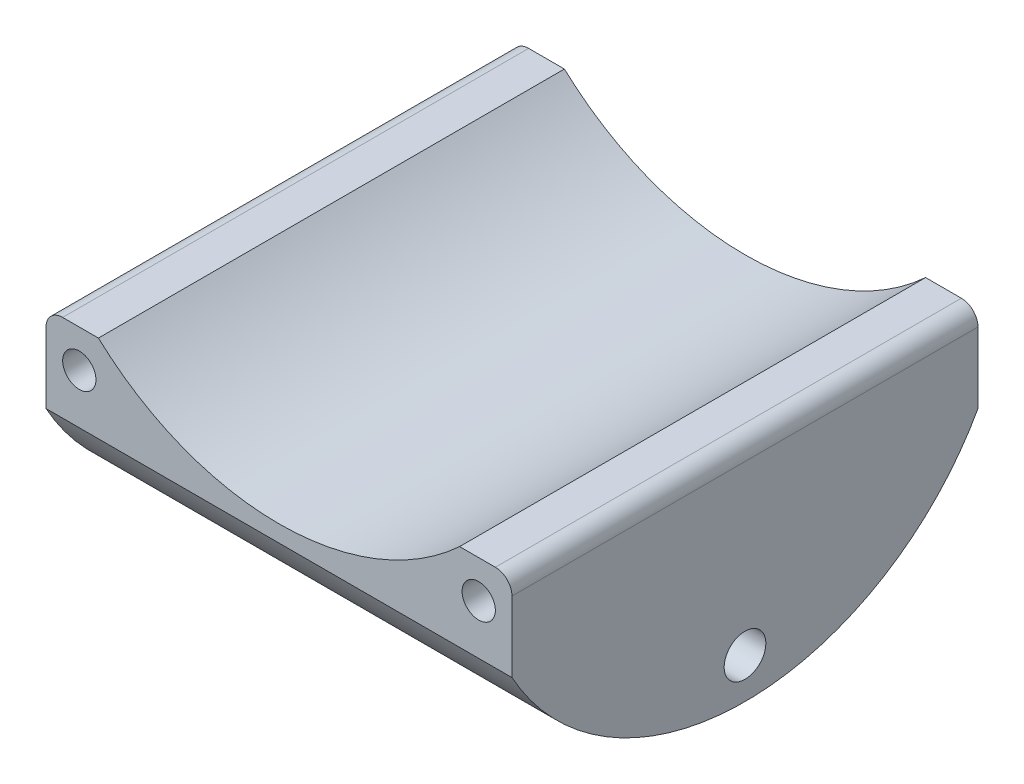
ISO-10303-21;
HEADER;
FILE_DESCRIPTION(('STEP AP214'),'2;1');
FILE_NAME('part.step','',(''),(''),'','','');
FILE_SCHEMA(('AUTOMOTIVE_DESIGN { 1 0 10303 214 1 1 1 1 }'));
ENDSEC;
DATA;
#1=APPLICATION_CONTEXT('core data for automotive mechanical design processes');
#2=APPLICATION_PROTOCOL_DEFINITION('international standard','automotive_design',2000,#1);
#3=PRODUCT_CONTEXT('',#1,'mechanical');
#4=PRODUCT('Part','Part','',(#3));
#5=PRODUCT_RELATED_PRODUCT_CATEGORY('part','',(#4));
#6=PRODUCT_DEFINITION_FORMATION('','',#4);
#7=PRODUCT_DEFINITION_CONTEXT('part definition',#1,'design');
#8=PRODUCT_DEFINITION('design','',#6,#7);
#9=PRODUCT_DEFINITION_SHAPE('','',#8);
#10=(LENGTH_UNIT() NAMED_UNIT(*) SI_UNIT(.MILLI.,.METRE.));
#11=(NAMED_UNIT(*) PLANE_ANGLE_UNIT() SI_UNIT($,.RADIAN.));
#12=(NAMED_UNIT(*) SI_UNIT($,.STERADIAN.) SOLID_ANGLE_UNIT());
#13=UNCERTAINTY_MEASURE_WITH_UNIT(LENGTH_MEASURE(1.E-05),#10,'distance_accuracy_value','');
#14=(GEOMETRIC_REPRESENTATION_CONTEXT(3) GLOBAL_UNCERTAINTY_ASSIGNED_CONTEXT((#13)) GLOBAL_UNIT_ASSIGNED_CONTEXT((#10,
#11,#12)) REPRESENTATION_CONTEXT('',''));
#15=CARTESIAN_POINT('',(0.,0.,0.));
#16=DIRECTION('',(0.,0.,1.));
#17=DIRECTION('',(1.,0.,0.));
#18=AXIS2_PLACEMENT_3D('',#15,#16,#17);
#19=CARTESIAN_POINT('',(-44.45,7.9502,0.));
#20=DIRECTION('',(1.,0.,0.));
#21=DIRECTION('',(0.,0.,-1.));
#22=AXIS2_PLACEMENT_3D('',#19,#20,#21);
#23=PLANE('',#22);
#24=DIRECTION('',(0.,-1.,0.));
#25=VECTOR('',#24,1.);
#26=CARTESIAN_POINT('',(-44.45,0.,44.45));
#27=LINE('',#26,#25);
#28=CARTESIAN_POINT('',(-44.45,-3.175,44.45));
#29=VERTEX_POINT('',#28);
#30=CARTESIAN_POINT('',(-44.45,-16.6432442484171,44.45));
#31=VERTEX_POINT('',#30);
#32=EDGE_CURVE('E161',#29,#31,#27,.T.);
#33=ORIENTED_EDGE('',*,*,#32,.F.);
#34=DIRECTION('',(0.,0.,-1.));
#35=VECTOR('',#34,1.);
#36=CARTESIAN_POINT('',(-44.45,-3.175,-44.45));
#37=LINE('',#36,#35);
#38=CARTESIAN_POINT('',(-44.45,-3.175,-44.45));
#39=VERTEX_POINT('',#38);
#40=EDGE_CURVE('E51',#29,#39,#37,.T.);
#41=ORIENTED_EDGE('',*,*,#40,.T.);
#42=DIRECTION('',(0.,-1.,0.));
#43=VECTOR('',#42,1.);
#44=CARTESIAN_POINT('',(-44.45,0.,-44.45));
#45=LINE('',#44,#43);
#46=CARTESIAN_POINT('',(-44.45,-16.6432442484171,-44.45));
#47=VERTEX_POINT('',#46);
#48=EDGE_CURVE('E134',#39,#47,#45,.T.);
#49=ORIENTED_EDGE('',*,*,#48,.T.);
#50=CARTESIAN_POINT('',(-44.45,7.9502,0.));
#51=DIRECTION('',(1.,0.,0.));
#52=DIRECTION('',(0.,0.,-1.));
#53=AXIS2_PLACEMENT_3D('',#50,#51,#52);
#54=CIRCLE('',#53,50.8);
#55=EDGE_CURVE('E170',#31,#47,#54,.T.);
#56=ORIENTED_EDGE('',*,*,#55,.F.);
#57=EDGE_LOOP('',(#33,#41,#49,#56));
#58=FACE_BOUND('',#57,.T.);
#59=CARTESIAN_POINT('',(-44.45,-35.179,0.));
#60=DIRECTION('',(1.,0.,0.));
#61=DIRECTION('',(0.,0.,-1.));
#62=AXIS2_PLACEMENT_3D('',#59,#60,#61);
#63=CIRCLE('',#62,3.9751);
#64=CARTESIAN_POINT('',(-44.45,-35.179,-3.9751));
#65=VERTEX_POINT('',#64);
#66=EDGE_CURVE('E209',#65,#65,#63,.T.);
#67=ORIENTED_EDGE('',*,*,#66,.T.);
#68=EDGE_LOOP('',(#67));
#69=FACE_BOUND('',#68,.T.);
#70=ADVANCED_FACE('F43',(#58,#69),#23,.F.);
#71=CARTESIAN_POINT('',(44.45,0.,-44.45));
#72=DIRECTION('',(0.,0.,-1.));
#73=DIRECTION('',(0.,1.,0.));
#74=AXIS2_PLACEMENT_3D('',#71,#72,#73);
#75=PLANE('',#74);
#76=CARTESIAN_POINT('',(-38.1,-7.13740000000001,-44.45));
#77=DIRECTION('',(0.,0.,1.));
#78=DIRECTION('',(1.,0.,0.));
#79=AXIS2_PLACEMENT_3D('',#76,#77,#78);
#80=CIRCLE('',#79,3.17500000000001);
#81=CARTESIAN_POINT('',(-34.925,-7.13740000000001,-44.45));
#82=VERTEX_POINT('',#81);
#83=EDGE_CURVE('E191',#82,#82,#80,.T.);
#84=ORIENTED_EDGE('',*,*,#83,.T.);
#85=EDGE_LOOP('',(#84));
#86=FACE_BOUND('',#85,.T.);
#87=DIRECTION('',(-1.,0.,0.));
#88=VECTOR('',#87,1.);
#89=CARTESIAN_POINT('',(44.45,0.,-44.45));
#90=LINE('',#89,#88);
#91=CARTESIAN_POINT('',(41.275,0.,-44.45));
#92=VERTEX_POINT('',#91);
#93=CARTESIAN_POINT('',(34.4525762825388,0.,-44.45));
#94=VERTEX_POINT('',#93);
#95=EDGE_CURVE('E136',#92,#94,#90,.T.);
#96=ORIENTED_EDGE('',*,*,#95,.F.);
#97=CARTESIAN_POINT('',(41.275,-3.175,-44.45));
#98=DIRECTION('',(0.,0.,-1.));
#99=DIRECTION('',(0.,1.,0.));
#100=AXIS2_PLACEMENT_3D('',#97,#98,#99);
#101=CIRCLE('',#100,3.175);
#102=CARTESIAN_POINT('',(44.45,-3.175,-44.45));
#103=VERTEX_POINT('',#102);
#104=EDGE_CURVE('E149',#92,#103,#101,.T.);
#105=ORIENTED_EDGE('',*,*,#104,.T.);
#106=DIRECTION('',(0.,-1.,0.));
#107=VECTOR('',#106,1.);
#108=CARTESIAN_POINT('',(44.45,0.,-44.45));
#109=LINE('',#108,#107);
#110=CARTESIAN_POINT('',(44.45,-16.6432442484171,-44.45));
#111=VERTEX_POINT('',#110);
#112=EDGE_CURVE('E127',#103,#111,#109,.T.);
#113=ORIENTED_EDGE('',*,*,#112,.T.);
#114=DIRECTION('',(-1.,0.,0.));
#115=VECTOR('',#114,1.);
#116=CARTESIAN_POINT('',(44.45,-16.6432442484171,-44.45));
#117=LINE('',#116,#115);
#118=EDGE_CURVE('E138',#111,#47,#117,.T.);
#119=ORIENTED_EDGE('',*,*,#118,.T.);
#120=ORIENTED_EDGE('',*,*,#48,.F.);
#121=CARTESIAN_POINT('',(-41.275,-3.175,-44.45));
#122=DIRECTION('',(0.,0.,-1.));
#123=DIRECTION('',(0.,1.,0.));
#124=AXIS2_PLACEMENT_3D('',#121,#122,#123);
#125=CIRCLE('',#124,3.175);
#126=CARTESIAN_POINT('',(-41.275,0.,-44.45));
#127=VERTEX_POINT('',#126);
#128=EDGE_CURVE('E147',#39,#127,#125,.T.);
#129=ORIENTED_EDGE('',*,*,#128,.T.);
#130=CARTESIAN_POINT('',(-34.4525762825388,0.,-44.45));
#131=VERTEX_POINT('',#130);
#132=EDGE_CURVE('E129',#131,#127,#90,.T.);
#133=ORIENTED_EDGE('',*,*,#132,.F.);
#134=CARTESIAN_POINT('',(0.,37.3317557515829,-44.45));
#135=DIRECTION('',(0.,0.,-1.));
#136=DIRECTION('',(0.,1.,0.));
#137=AXIS2_PLACEMENT_3D('',#134,#135,#136);
#138=CIRCLE('',#137,50.8);
#139=EDGE_CURVE('E115',#131,#94,#138,.F.);
#140=ORIENTED_EDGE('',*,*,#139,.T.);
#141=EDGE_LOOP('',(#96,#105,#113,#119,#120,#129,#133,#140));
#142=FACE_BOUND('',#141,.T.);
#143=CARTESIAN_POINT('',(38.1,-7.13740000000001,-44.45));
#144=DIRECTION('',(0.,0.,1.));
#145=DIRECTION('',(1.,0.,0.));
#146=AXIS2_PLACEMENT_3D('',#143,#144,#145);
#147=CIRCLE('',#146,3.17500000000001);
#148=CARTESIAN_POINT('',(41.275,-7.13740000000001,-44.45));
#149=VERTEX_POINT('',#148);
#150=EDGE_CURVE('E197',#149,#149,#147,.T.);
#151=ORIENTED_EDGE('',*,*,#150,.T.);
#152=EDGE_LOOP('',(#151));
#153=FACE_BOUND('',#152,.T.);
#154=ADVANCED_FACE('F165',(#86,#142,#153),#75,.T.);
#155=CARTESIAN_POINT('',(44.45,0.,44.45));
#156=DIRECTION('',(0.,0.,-1.));
#157=DIRECTION('',(0.,1.,0.));
#158=AXIS2_PLACEMENT_3D('',#155,#156,#157);
#159=PLANE('',#158);
#160=CARTESIAN_POINT('',(38.1,-7.13740000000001,44.45));
#161=DIRECTION('',(0.,0.,1.));
#162=DIRECTION('',(1.,0.,0.));
#163=AXIS2_PLACEMENT_3D('',#160,#161,#162);
#164=CIRCLE('',#163,3.17500000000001);
#165=CARTESIAN_POINT('',(41.275,-7.13740000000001,44.45));
#166=VERTEX_POINT('',#165);
#167=EDGE_CURVE('E187',#166,#166,#164,.T.);
#168=ORIENTED_EDGE('',*,*,#167,.F.);
#169=EDGE_LOOP('',(#168));
#170=FACE_BOUND('',#169,.T.);
#171=CARTESIAN_POINT('',(-38.1,-7.13740000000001,44.45));
#172=DIRECTION('',(0.,0.,1.));
#173=DIRECTION('',(1.,0.,0.));
#174=AXIS2_PLACEMENT_3D('',#171,#172,#173);
#175=CIRCLE('',#174,3.17500000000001);
#176=CARTESIAN_POINT('',(-34.925,-7.13740000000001,44.45));
#177=VERTEX_POINT('',#176);
#178=EDGE_CURVE('E179',#177,#177,#175,.T.);
#179=ORIENTED_EDGE('',*,*,#178,.F.);
#180=EDGE_LOOP('',(#179));
#181=FACE_BOUND('',#180,.T.);
#182=DIRECTION('',(0.,-1.,0.));
#183=VECTOR('',#182,1.);
#184=CARTESIAN_POINT('',(44.45,0.,44.45));
#185=LINE('',#184,#183);
#186=CARTESIAN_POINT('',(44.45,-3.175,44.45));
#187=VERTEX_POINT('',#186);
#188=CARTESIAN_POINT('',(44.45,-16.6432442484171,44.45));
#189=VERTEX_POINT('',#188);
#190=EDGE_CURVE('E169',#187,#189,#185,.T.);
#191=ORIENTED_EDGE('',*,*,#190,.F.);
#192=CARTESIAN_POINT('',(41.275,-3.175,44.45));
#193=DIRECTION('',(0.,0.,-1.));
#194=DIRECTION('',(0.,1.,0.));
#195=AXIS2_PLACEMENT_3D('',#192,#193,#194);
#196=CIRCLE('',#195,3.175);
#197=CARTESIAN_POINT('',(41.275,0.,44.45));
#198=VERTEX_POINT('',#197);
#199=EDGE_CURVE('E154',#187,#198,#196,.F.);
#200=ORIENTED_EDGE('',*,*,#199,.T.);
#201=DIRECTION('',(-1.,0.,0.));
#202=VECTOR('',#201,1.);
#203=CARTESIAN_POINT('',(44.45,0.,44.45));
#204=LINE('',#203,#202);
#205=CARTESIAN_POINT('',(34.4525762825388,0.,44.45));
#206=VERTEX_POINT('',#205);
#207=EDGE_CURVE('E123',#198,#206,#204,.T.);
#208=ORIENTED_EDGE('',*,*,#207,.T.);
#209=CARTESIAN_POINT('',(0.,37.3317557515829,44.45));
#210=DIRECTION('',(0.,0.,1.));
#211=DIRECTION('',(1.,0.,0.));
#212=AXIS2_PLACEMENT_3D('',#209,#210,#211);
#213=CIRCLE('',#212,50.8);
#214=CARTESIAN_POINT('',(-34.4525762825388,0.,44.45));
#215=VERTEX_POINT('',#214);
#216=EDGE_CURVE('E112',#215,#206,#213,.T.);
#217=ORIENTED_EDGE('',*,*,#216,.F.);
#218=CARTESIAN_POINT('',(-41.275,0.,44.45));
#219=VERTEX_POINT('',#218);
#220=EDGE_CURVE('E121',#215,#219,#204,.T.);
#221=ORIENTED_EDGE('',*,*,#220,.T.);
#222=CARTESIAN_POINT('',(-41.275,-3.175,44.45));
#223=DIRECTION('',(0.,0.,-1.));
#224=DIRECTION('',(0.,1.,0.));
#225=AXIS2_PLACEMENT_3D('',#222,#223,#224);
#226=CIRCLE('',#225,3.175);
#227=EDGE_CURVE('E58',#219,#29,#226,.F.);
#228=ORIENTED_EDGE('',*,*,#227,.T.);
#229=ORIENTED_EDGE('',*,*,#32,.T.);
#230=DIRECTION('',(-1.,0.,0.));
#231=VECTOR('',#230,1.);
#232=CARTESIAN_POINT('',(44.45,-16.6432442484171,44.45));
#233=LINE('',#232,#231);
#234=EDGE_CURVE('E141',#189,#31,#233,.T.);
#235=ORIENTED_EDGE('',*,*,#234,.F.);
#236=EDGE_LOOP('',(#191,#200,#208,#217,#221,#228,#229,#235));
#237=FACE_BOUND('',#236,.T.);
#238=ADVANCED_FACE('F120',(#170,#181,#237),#159,.F.);
#239=CARTESIAN_POINT('',(44.45,0.,44.45));
#240=DIRECTION('',(0.,1.,0.));
#241=DIRECTION('',(0.,0.,1.));
#242=AXIS2_PLACEMENT_3D('',#239,#240,#241);
#243=PLANE('',#242);
#244=ORIENTED_EDGE('',*,*,#207,.F.);
#245=DIRECTION('',(0.,0.,-1.));
#246=VECTOR('',#245,1.);
#247=CARTESIAN_POINT('',(41.275,0.,44.45));
#248=LINE('',#247,#246);
#249=EDGE_CURVE('E144',#198,#92,#248,.T.);
#250=ORIENTED_EDGE('',*,*,#249,.T.);
#251=ORIENTED_EDGE('',*,*,#95,.T.);
#252=DIRECTION('',(0.,0.,-1.));
#253=VECTOR('',#252,1.);
#254=CARTESIAN_POINT('',(34.4525762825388,0.,44.45));
#255=LINE('',#254,#253);
#256=EDGE_CURVE('E124',#206,#94,#255,.T.);
#257=ORIENTED_EDGE('',*,*,#256,.F.);
#258=EDGE_LOOP('',(#244,#250,#251,#257));
#259=FACE_BOUND('',#258,.T.);
#260=ADVANCED_FACE('F239',(#259),#243,.T.);
#261=ORIENTED_EDGE('',*,*,#132,.T.);
#262=DIRECTION('',(0.,0.,-1.));
#263=VECTOR('',#262,1.);
#264=CARTESIAN_POINT('',(-41.275,0.,44.45));
#265=LINE('',#264,#263);
#266=EDGE_CURVE('E11',#127,#219,#265,.F.);
#267=ORIENTED_EDGE('',*,*,#266,.T.);
#268=ORIENTED_EDGE('',*,*,#220,.F.);
#269=DIRECTION('',(0.,0.,-1.));
#270=VECTOR('',#269,1.);
#271=CARTESIAN_POINT('',(-34.4525762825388,0.,44.45));
#272=LINE('',#271,#270);
#273=EDGE_CURVE('E108',#215,#131,#272,.T.);
#274=ORIENTED_EDGE('',*,*,#273,.T.);
#275=EDGE_LOOP('',(#261,#267,#268,#274));
#276=FACE_BOUND('',#275,.T.);
#277=ADVANCED_FACE('F126',(#276),#243,.T.);
#278=CARTESIAN_POINT('',(44.45,7.9502,0.));
#279=DIRECTION('',(-1.,0.,0.));
#280=DIRECTION('',(0.,0.,1.));
#281=AXIS2_PLACEMENT_3D('',#278,#279,#280);
#282=CYLINDRICAL_SURFACE('',#281,50.8);
#283=ORIENTED_EDGE('',*,*,#55,.T.);
#284=ORIENTED_EDGE('',*,*,#118,.F.);
#285=CARTESIAN_POINT('',(44.45,7.9502,0.));
#286=DIRECTION('',(1.,0.,0.));
#287=DIRECTION('',(0.,0.,-1.));
#288=AXIS2_PLACEMENT_3D('',#285,#286,#287);
#289=CIRCLE('',#288,50.8);
#290=EDGE_CURVE('E130',#189,#111,#289,.T.);
#291=ORIENTED_EDGE('',*,*,#290,.F.);
#292=ORIENTED_EDGE('',*,*,#234,.T.);
#293=EDGE_LOOP('',(#283,#284,#291,#292));
#294=FACE_BOUND('',#293,.T.);
#295=ADVANCED_FACE('F243',(#294),#282,.T.);
#296=CARTESIAN_POINT('',(44.45,7.9502,0.));
#297=DIRECTION('',(1.,0.,0.));
#298=DIRECTION('',(0.,0.,-1.));
#299=AXIS2_PLACEMENT_3D('',#296,#297,#298);
#300=PLANE('',#299);
#301=CARTESIAN_POINT('',(44.45,-35.179,0.));
#302=DIRECTION('',(1.,0.,0.));
#303=DIRECTION('',(0.,0.,-1.));
#304=AXIS2_PLACEMENT_3D('',#301,#302,#303);
#305=CIRCLE('',#304,3.9751);
#306=CARTESIAN_POINT('',(44.45,-35.179,-3.9751));
#307=VERTEX_POINT('',#306);
#308=EDGE_CURVE('E203',#307,#307,#305,.T.);
#309=ORIENTED_EDGE('',*,*,#308,.F.);
#310=EDGE_LOOP('',(#309));
#311=FACE_BOUND('',#310,.T.);
#312=ORIENTED_EDGE('',*,*,#112,.F.);
#313=DIRECTION('',(0.,0.,-1.));
#314=VECTOR('',#313,1.);
#315=CARTESIAN_POINT('',(44.45,-3.175,0.));
#316=LINE('',#315,#314);
#317=EDGE_CURVE('E151',#103,#187,#316,.F.);
#318=ORIENTED_EDGE('',*,*,#317,.T.);
#319=ORIENTED_EDGE('',*,*,#190,.T.);
#320=ORIENTED_EDGE('',*,*,#290,.T.);
#321=EDGE_LOOP('',(#312,#318,#319,#320));
#322=FACE_BOUND('',#321,.T.);
#323=ADVANCED_FACE('F237',(#311,#322),#300,.T.);
#324=CARTESIAN_POINT('',(0.,37.3317557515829,44.45));
#325=DIRECTION('',(0.,0.,-1.));
#326=DIRECTION('',(-1.,0.,0.));
#327=AXIS2_PLACEMENT_3D('',#324,#325,#326);
#328=CYLINDRICAL_SURFACE('',#327,50.8);
#329=ORIENTED_EDGE('',*,*,#139,.F.);
#330=ORIENTED_EDGE('',*,*,#273,.F.);
#331=ORIENTED_EDGE('',*,*,#216,.T.);
#332=ORIENTED_EDGE('',*,*,#256,.T.);
#333=EDGE_LOOP('',(#329,#330,#331,#332));
#334=FACE_BOUND('',#333,.T.);
#335=ADVANCED_FACE('F110',(#334),#328,.F.);
#336=CARTESIAN_POINT('',(41.275,-3.175,44.45));
#337=DIRECTION('',(0.,0.,-1.));
#338=DIRECTION('',(-1.,0.,0.));
#339=AXIS2_PLACEMENT_3D('',#336,#337,#338);
#340=CYLINDRICAL_SURFACE('',#339,3.175);
#341=ORIENTED_EDGE('',*,*,#199,.F.);
#342=ORIENTED_EDGE('',*,*,#317,.F.);
#343=ORIENTED_EDGE('',*,*,#104,.F.);
#344=ORIENTED_EDGE('',*,*,#249,.F.);
#345=EDGE_LOOP('',(#341,#342,#343,#344));
#346=FACE_BOUND('',#345,.T.);
#347=ADVANCED_FACE('F248',(#346),#340,.T.);
#348=CARTESIAN_POINT('',(-41.275,-3.175,0.));
#349=DIRECTION('',(0.,0.,1.));
#350=DIRECTION('',(1.,0.,0.));
#351=AXIS2_PLACEMENT_3D('',#348,#349,#350);
#352=CYLINDRICAL_SURFACE('',#351,3.175);
#353=ORIENTED_EDGE('',*,*,#227,.F.);
#354=ORIENTED_EDGE('',*,*,#266,.F.);
#355=ORIENTED_EDGE('',*,*,#128,.F.);
#356=ORIENTED_EDGE('',*,*,#40,.F.);
#357=EDGE_LOOP('',(#353,#354,#355,#356));
#358=FACE_BOUND('',#357,.T.);
#359=ADVANCED_FACE('F45',(#358),#352,.T.);
#360=CARTESIAN_POINT('',(-38.1,-7.13740000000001,23.8125));
#361=DIRECTION('',(0.,0.,1.));
#362=DIRECTION('',(1.,0.,0.));
#363=AXIS2_PLACEMENT_3D('',#360,#361,#362);
#364=CYLINDRICAL_SURFACE('',#363,3.17500000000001);
#365=CARTESIAN_POINT('',(-38.1,-7.13740000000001,23.8125));
#366=DIRECTION('',(0.,0.,1.));
#367=DIRECTION('',(1.,0.,0.));
#368=AXIS2_PLACEMENT_3D('',#365,#366,#367);
#369=CIRCLE('',#368,3.17500000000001);
#370=CARTESIAN_POINT('',(-34.925,-7.13740000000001,23.8125));
#371=VERTEX_POINT('',#370);
#372=EDGE_CURVE('E117',#371,#371,#369,.T.);
#373=ORIENTED_EDGE('',*,*,#372,.F.);
#374=EDGE_LOOP('',(#373));
#375=FACE_BOUND('',#374,.T.);
#376=ORIENTED_EDGE('',*,*,#178,.T.);
#377=EDGE_LOOP('',(#376));
#378=FACE_BOUND('',#377,.T.);
#379=ADVANCED_FACE('F255',(#375,#378),#364,.F.);
#380=CARTESIAN_POINT('',(-38.1,-7.13740000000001,23.8125));
#381=DIRECTION('',(0.,0.,1.));
#382=DIRECTION('',(1.,0.,0.));
#383=AXIS2_PLACEMENT_3D('',#380,#381,#382);
#384=PLANE('',#383);
#385=ORIENTED_EDGE('',*,*,#372,.T.);
#386=EDGE_LOOP('',(#385));
#387=FACE_BOUND('',#386,.T.);
#388=ADVANCED_FACE('F304',(#387),#384,.T.);
#389=CARTESIAN_POINT('',(38.1,-7.13740000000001,23.8125));
#390=DIRECTION('',(0.,0.,1.));
#391=DIRECTION('',(1.,0.,0.));
#392=AXIS2_PLACEMENT_3D('',#389,#390,#391);
#393=CYLINDRICAL_SURFACE('',#392,3.17500000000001);
#394=CARTESIAN_POINT('',(38.1,-7.13740000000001,23.8125));
#395=DIRECTION('',(0.,0.,1.));
#396=DIRECTION('',(1.,0.,0.));
#397=AXIS2_PLACEMENT_3D('',#394,#395,#396);
#398=CIRCLE('',#397,3.17500000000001);
#399=CARTESIAN_POINT('',(41.275,-7.13740000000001,23.8125));
#400=VERTEX_POINT('',#399);
#401=EDGE_CURVE('E182',#400,#400,#398,.T.);
#402=ORIENTED_EDGE('',*,*,#401,.F.);
#403=EDGE_LOOP('',(#402));
#404=FACE_BOUND('',#403,.T.);
#405=ORIENTED_EDGE('',*,*,#167,.T.);
#406=EDGE_LOOP('',(#405));
#407=FACE_BOUND('',#406,.T.);
#408=ADVANCED_FACE('F300',(#404,#407),#393,.F.);
#409=CARTESIAN_POINT('',(38.1,-7.13740000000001,23.8125));
#410=DIRECTION('',(0.,0.,1.));
#411=DIRECTION('',(1.,0.,0.));
#412=AXIS2_PLACEMENT_3D('',#409,#410,#411);
#413=PLANE('',#412);
#414=ORIENTED_EDGE('',*,*,#401,.T.);
#415=EDGE_LOOP('',(#414));
#416=FACE_BOUND('',#415,.T.);
#417=ADVANCED_FACE('F296',(#416),#413,.T.);
#418=CARTESIAN_POINT('',(-38.1,-7.13740000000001,-23.8125));
#419=DIRECTION('',(0.,0.,-1.));
#420=DIRECTION('',(-1.,0.,0.));
#421=AXIS2_PLACEMENT_3D('',#418,#419,#420);
#422=CYLINDRICAL_SURFACE('',#421,3.17500000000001);
#423=CARTESIAN_POINT('',(-38.1,-7.13740000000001,-23.8125));
#424=DIRECTION('',(0.,0.,1.));
#425=DIRECTION('',(1.,0.,0.));
#426=AXIS2_PLACEMENT_3D('',#423,#424,#425);
#427=CIRCLE('',#426,3.17500000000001);
#428=CARTESIAN_POINT('',(-34.925,-7.13740000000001,-23.8125));
#429=VERTEX_POINT('',#428);
#430=EDGE_CURVE('E190',#429,#429,#427,.T.);
#431=ORIENTED_EDGE('',*,*,#430,.T.);
#432=EDGE_LOOP('',(#431));
#433=FACE_BOUND('',#432,.T.);
#434=ORIENTED_EDGE('',*,*,#83,.F.);
#435=EDGE_LOOP('',(#434));
#436=FACE_BOUND('',#435,.T.);
#437=ADVANCED_FACE('F292',(#433,#436),#422,.F.);
#438=CARTESIAN_POINT('',(-38.1,-7.13740000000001,-23.8125));
#439=DIRECTION('',(0.,0.,-1.));
#440=DIRECTION('',(1.,0.,0.));
#441=AXIS2_PLACEMENT_3D('',#438,#439,#440);
#442=PLANE('',#441);
#443=ORIENTED_EDGE('',*,*,#430,.F.);
#444=EDGE_LOOP('',(#443));
#445=FACE_BOUND('',#444,.T.);
#446=ADVANCED_FACE('F288',(#445),#442,.T.);
#447=CARTESIAN_POINT('',(38.1,-7.13740000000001,-23.8125));
#448=DIRECTION('',(0.,0.,-1.));
#449=DIRECTION('',(-1.,0.,0.));
#450=AXIS2_PLACEMENT_3D('',#447,#448,#449);
#451=CYLINDRICAL_SURFACE('',#450,3.17500000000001);
#452=CARTESIAN_POINT('',(38.1,-7.13740000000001,-23.8125));
#453=DIRECTION('',(0.,0.,1.));
#454=DIRECTION('',(1.,0.,0.));
#455=AXIS2_PLACEMENT_3D('',#452,#453,#454);
#456=CIRCLE('',#455,3.17500000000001);
#457=CARTESIAN_POINT('',(41.275,-7.13740000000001,-23.8125));
#458=VERTEX_POINT('',#457);
#459=EDGE_CURVE('E194',#458,#458,#456,.T.);
#460=ORIENTED_EDGE('',*,*,#459,.T.);
#461=EDGE_LOOP('',(#460));
#462=FACE_BOUND('',#461,.T.);
#463=ORIENTED_EDGE('',*,*,#150,.F.);
#464=EDGE_LOOP('',(#463));
#465=FACE_BOUND('',#464,.T.);
#466=ADVANCED_FACE('F282',(#462,#465),#451,.F.);
#467=CARTESIAN_POINT('',(38.1,-7.13740000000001,-23.8125));
#468=DIRECTION('',(0.,0.,-1.));
#469=DIRECTION('',(1.,0.,0.));
#470=AXIS2_PLACEMENT_3D('',#467,#468,#469);
#471=PLANE('',#470);
#472=ORIENTED_EDGE('',*,*,#459,.F.);
#473=EDGE_LOOP('',(#472));
#474=FACE_BOUND('',#473,.T.);
#475=ADVANCED_FACE('F274',(#474),#471,.T.);
#476=CARTESIAN_POINT('',(26.9875,-35.179,0.));
#477=DIRECTION('',(1.,0.,0.));
#478=DIRECTION('',(0.,0.,-1.));
#479=AXIS2_PLACEMENT_3D('',#476,#477,#478);
#480=CYLINDRICAL_SURFACE('',#479,3.9751);
#481=CARTESIAN_POINT('',(26.9875,-35.179,0.));
#482=DIRECTION('',(1.,0.,0.));
#483=DIRECTION('',(0.,0.,-1.));
#484=AXIS2_PLACEMENT_3D('',#481,#482,#483);
#485=CIRCLE('',#484,3.9751);
#486=CARTESIAN_POINT('',(26.9875,-35.179,-3.9751));
#487=VERTEX_POINT('',#486);
#488=EDGE_CURVE('E200',#487,#487,#485,.T.);
#489=ORIENTED_EDGE('',*,*,#488,.F.);
#490=EDGE_LOOP('',(#489));
#491=FACE_BOUND('',#490,.T.);
#492=ORIENTED_EDGE('',*,*,#308,.T.);
#493=EDGE_LOOP('',(#492));
#494=FACE_BOUND('',#493,.T.);
#495=ADVANCED_FACE('F272',(#491,#494),#480,.F.);
#496=CARTESIAN_POINT('',(26.9875,-35.179,0.));
#497=DIRECTION('',(1.,0.,0.));
#498=DIRECTION('',(0.,0.,-1.));
#499=AXIS2_PLACEMENT_3D('',#496,#497,#498);
#500=PLANE('',#499);
#501=ORIENTED_EDGE('',*,*,#488,.T.);
#502=EDGE_LOOP('',(#501));
#503=FACE_BOUND('',#502,.T.);
#504=ADVANCED_FACE('F225',(#503),#500,.T.);
#505=CARTESIAN_POINT('',(-26.9875,-35.179,0.));
#506=DIRECTION('',(-1.,0.,0.));
#507=DIRECTION('',(0.,0.,1.));
#508=AXIS2_PLACEMENT_3D('',#505,#506,#507);
#509=CYLINDRICAL_SURFACE('',#508,3.9751);
#510=CARTESIAN_POINT('',(-26.9875,-35.179,0.));
#511=DIRECTION('',(1.,0.,0.));
#512=DIRECTION('',(0.,0.,-1.));
#513=AXIS2_PLACEMENT_3D('',#510,#511,#512);
#514=CIRCLE('',#513,3.9751);
#515=CARTESIAN_POINT('',(-26.9875,-35.179,-3.9751));
#516=VERTEX_POINT('',#515);
#517=EDGE_CURVE('E206',#516,#516,#514,.T.);
#518=ORIENTED_EDGE('',*,*,#517,.T.);
#519=EDGE_LOOP('',(#518));
#520=FACE_BOUND('',#519,.T.);
#521=ORIENTED_EDGE('',*,*,#66,.F.);
#522=EDGE_LOOP('',(#521));
#523=FACE_BOUND('',#522,.T.);
#524=ADVANCED_FACE('F215',(#520,#523),#509,.F.);
#525=CARTESIAN_POINT('',(-26.9875,-35.179,0.));
#526=DIRECTION('',(-1.,0.,0.));
#527=DIRECTION('',(0.,0.,-1.));
#528=AXIS2_PLACEMENT_3D('',#525,#526,#527);
#529=PLANE('',#528);
#530=ORIENTED_EDGE('',*,*,#517,.F.);
#531=EDGE_LOOP('',(#530));
#532=FACE_BOUND('',#531,.T.);
#533=ADVANCED_FACE('F218',(#532),#529,.T.);
#534=CLOSED_SHELL('',(#70,#154,#238,#260,#277,#295,#323,#335,#347,#359,#379,#388,#408,#417,#437,
#446,#466,#475,#495,#504,#524,#533));
#535=MANIFOLD_SOLID_BREP('B2',#534);
#536=ADVANCED_BREP_SHAPE_REPRESENTATION('',(#18,#535),#14);
#537=SHAPE_DEFINITION_REPRESENTATION(#9,#536);
ENDSEC;
END-ISO-10303-21;
